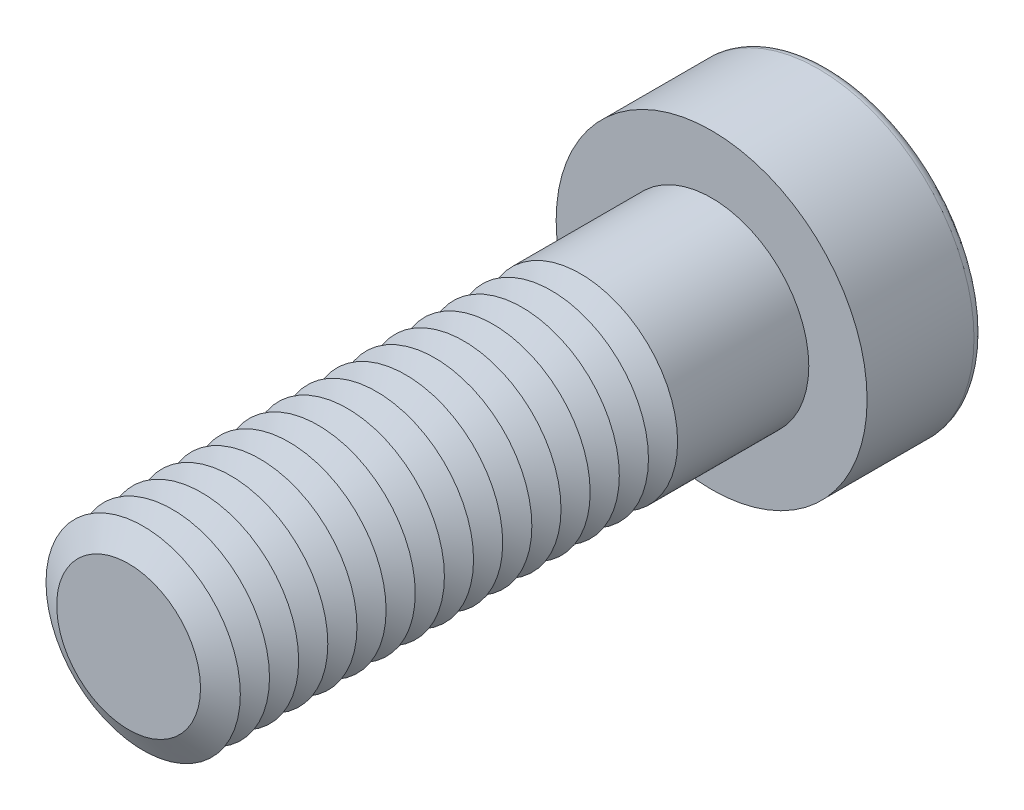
from build123d import *

# Parameters (mm, degrees)
SKETCH1_R           = 5
BOSS_EXTRUDE1_DEPTH = 30
SKETCH2_R           = 8
BOSS_EXTRUDE2_DEPTH = 6
CUT_EXTRUDE1_DEPTH  = 5.25
FILLET1_R           = 0.5
LPATTERN1_COUNT     = 16
LPATTERN1_PITCH     = 1.5


with BuildPart() as part:
    # Sketch1 → Boss-Extrude1 (new body)
    with BuildSketch(Plane.XY):
        Circle(SKETCH1_R)
    extrude(amount=BOSS_EXTRUDE1_DEPTH)

    # Sketch2 → Boss-Extrude2 (add)
    with BuildSketch(Plane(origin=(0, 0, 0), x_dir=(-1, 0, 0), z_dir=(0, 0, -1))):
        Circle(SKETCH2_R)
    extrude(amount=BOSS_EXTRUDE2_DEPTH)

    # Sketch3 → Cut-Extrude1 (cut)
    with BuildSketch(Plane(origin=(0, 0, -6), x_dir=(-1, 0, 0), z_dir=(0, 0, -1))):
        Polygon((-2.020725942, 3.5), (-4.041451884, 0), (-2.020725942, -3.5), (2.020725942, -3.5), (4.041451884, 0), (2.020725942, 3.5), align=None)
    extrude(amount=-CUT_EXTRUDE1_DEPTH, mode=Mode.SUBTRACT)

    # Fillet1
    fillet1_edges = [part.edges().sort_by_distance(p)[0] for p in [
        (8, 0, -6),
    ]]
    fillet(fillet1_edges, radius=FILLET1_R)

    # Cut-Extrude2 cone 1 section (on through the dimple's axis) → Cut-Extrude2 (revolve, cut)
    with BuildSketch(Plane(origin=(0, 0, -0.75), x_dir=(0, 1, 0), z_dir=(1, 0, 0))):
        Polygon((0, 0), (3.5, 0), (0, 2.020725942), align=None)
    revolve(axis=Axis((0, 0, -0.75), (0, 0, 1)), mode=Mode.SUBTRACT)

    # Cut-Extrude3 cone 1 section (on through the dimple's axis) → Cut-Extrude3 (revolve, cut)
    with BuildSketch(Plane(origin=(0, 0, -6), x_dir=(0, 1, 0), z_dir=(1, 0, 0))):
        Polygon((0, 0), (4.041451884, 0), (0, 1.082903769), align=None)
    revolve(axis=Axis((0, 0, -6), (0, 0, 1)), mode=Mode.SUBTRACT)

    # Sketch7 → Cut-Revolve1 (revolve, cut)
    with BuildSketch(Plane(origin=(0, 0, 0), x_dir=(0, 0, -1), z_dir=(1, 0, 0)), mode=Mode.PRIVATE) as cut_revolve1_sk:
        Polygon((-30, 3.700961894), (-29.25, 5), (-30.75, 5), align=None)
    cut_revolve1 = revolve(cut_revolve1_sk.sketch.rotate(Axis((0, 0, 30), (0, 0, -1)), 90), axis=Axis((0, 0, 30), (0, 0, -1)), mode=Mode.SUBTRACT)

    # LPattern1: Cut-Revolve1 ×16
    with Locations(*[(0, 0, -i * LPATTERN1_PITCH) for i in range(1, LPATTERN1_COUNT)]):
        add(cut_revolve1, mode=Mode.SUBTRACT)


solid = part.part
